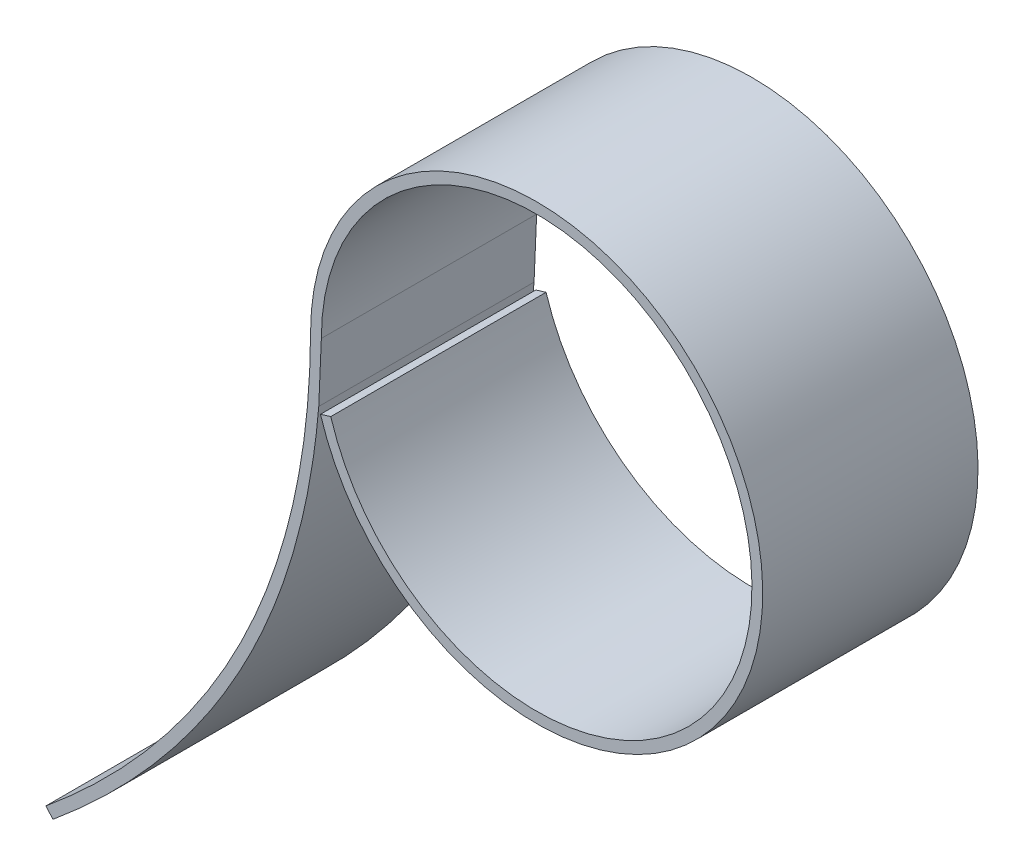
ISO-10303-21;
HEADER;
FILE_DESCRIPTION(('STEP AP214'),'2;1');
FILE_NAME('part.step','',(''),(''),'','','');
FILE_SCHEMA(('AUTOMOTIVE_DESIGN { 1 0 10303 214 1 1 1 1 }'));
ENDSEC;
DATA;
#1=APPLICATION_CONTEXT('core data for automotive mechanical design processes');
#2=APPLICATION_PROTOCOL_DEFINITION('international standard','automotive_design',2000,#1);
#3=PRODUCT_CONTEXT('',#1,'mechanical');
#4=PRODUCT('Part','Part','',(#3));
#5=PRODUCT_RELATED_PRODUCT_CATEGORY('part','',(#4));
#6=PRODUCT_DEFINITION_FORMATION('','',#4);
#7=PRODUCT_DEFINITION_CONTEXT('part definition',#1,'design');
#8=PRODUCT_DEFINITION('design','',#6,#7);
#9=PRODUCT_DEFINITION_SHAPE('','',#8);
#10=(LENGTH_UNIT() NAMED_UNIT(*) SI_UNIT(.MILLI.,.METRE.));
#11=(NAMED_UNIT(*) PLANE_ANGLE_UNIT() SI_UNIT($,.RADIAN.));
#12=(NAMED_UNIT(*) SI_UNIT($,.STERADIAN.) SOLID_ANGLE_UNIT());
#13=UNCERTAINTY_MEASURE_WITH_UNIT(LENGTH_MEASURE(1.E-05),#10,'distance_accuracy_value','');
#14=(GEOMETRIC_REPRESENTATION_CONTEXT(3) GLOBAL_UNCERTAINTY_ASSIGNED_CONTEXT((#13)) GLOBAL_UNIT_ASSIGNED_CONTEXT((#10,
#11,#12)) REPRESENTATION_CONTEXT('',''));
#15=CARTESIAN_POINT('',(0.,0.,0.));
#16=DIRECTION('',(0.,0.,1.));
#17=DIRECTION('',(1.,0.,0.));
#18=AXIS2_PLACEMENT_3D('',#15,#16,#17);
#19=CARTESIAN_POINT('',(-21.,0.,20.));
#20=CARTESIAN_POINT('',(-21.1540801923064,-30.1386727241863,20.));
#21=CARTESIAN_POINT('',(-45.5763785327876,-50.393394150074,20.));
#22=B_SPLINE_CURVE_WITH_KNOTS('',2,(#19,#20,#21),.UNSPECIFIED.,.F.,.F.,(3,3),(0.,1.),.UNSPECIFIED.);
#23=DIRECTION('',(0.,0.,-1.));
#24=VECTOR('',#23,1.);
#25=SURFACE_OF_LINEAR_EXTRUSION('',#22,#24);
#26=CARTESIAN_POINT('',(-21.,0.,0.));
#27=CARTESIAN_POINT('',(-21.1540801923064,-30.1386727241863,0.));
#28=CARTESIAN_POINT('',(-45.5763785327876,-50.393394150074,0.));
#29=B_SPLINE_CURVE_WITH_KNOTS('',2,(#26,#27,#28),.UNSPECIFIED.,.F.,.F.,(3,3),(0.,1.),.UNSPECIFIED.);
#30=CARTESIAN_POINT('',(-21.,0.,0.));
#31=VERTEX_POINT('',#30);
#32=CARTESIAN_POINT('',(-45.5763785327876,-50.393394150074,0.));
#33=VERTEX_POINT('',#32);
#34=EDGE_CURVE('E122',#31,#33,#29,.T.);
#35=ORIENTED_EDGE('',*,*,#34,.T.);
#36=DIRECTION('',(0.,0.,-1.));
#37=VECTOR('',#36,1.);
#38=CARTESIAN_POINT('',(-45.5763785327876,-50.393394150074,20.));
#39=LINE('',#38,#37);
#40=CARTESIAN_POINT('',(-45.5763785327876,-50.393394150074,20.));
#41=VERTEX_POINT('',#40);
#42=EDGE_CURVE('E11',#41,#33,#39,.T.);
#43=ORIENTED_EDGE('',*,*,#42,.F.);
#44=CARTESIAN_POINT('',(-21.,0.,20.));
#45=VERTEX_POINT('',#44);
#46=EDGE_CURVE('E144',#45,#41,#22,.T.);
#47=ORIENTED_EDGE('',*,*,#46,.F.);
#48=DIRECTION('',(0.,0.,-1.));
#49=VECTOR('',#48,1.);
#50=CARTESIAN_POINT('',(-21.,0.,20.));
#51=LINE('',#50,#49);
#52=EDGE_CURVE('E118',#45,#31,#51,.T.);
#53=ORIENTED_EDGE('',*,*,#52,.T.);
#54=EDGE_LOOP('',(#35,#43,#47,#53));
#55=FACE_BOUND('',#54,.T.);
#56=ADVANCED_FACE('F31',(#55),#25,.F.);
#57=CARTESIAN_POINT('',(-45.5763785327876,-50.393394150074,20.));
#58=DIRECTION('',(0.769725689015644,0.638374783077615,0.));
#59=DIRECTION('',(-0.638374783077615,0.769725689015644,0.));
#60=AXIS2_PLACEMENT_3D('',#57,#58,#59);
#61=PLANE('',#60);
#62=DIRECTION('',(0.638374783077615,-0.769725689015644,0.));
#63=VECTOR('',#62,1.);
#64=CARTESIAN_POINT('',(-45.5763785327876,-50.393394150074,0.));
#65=LINE('',#64,#63);
#66=CARTESIAN_POINT('',(-44.93800374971,-51.1631198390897,0.));
#67=VERTEX_POINT('',#66);
#68=EDGE_CURVE('E127',#33,#67,#65,.T.);
#69=ORIENTED_EDGE('',*,*,#68,.T.);
#70=DIRECTION('',(0.,0.,-1.));
#71=VECTOR('',#70,1.);
#72=CARTESIAN_POINT('',(-44.93800374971,-51.1631198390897,20.));
#73=LINE('',#72,#71);
#74=CARTESIAN_POINT('',(-44.93800374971,-51.1631198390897,20.));
#75=VERTEX_POINT('',#74);
#76=EDGE_CURVE('E40',#75,#67,#73,.T.);
#77=ORIENTED_EDGE('',*,*,#76,.F.);
#78=DIRECTION('',(0.638374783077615,-0.769725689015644,0.));
#79=VECTOR('',#78,1.);
#80=CARTESIAN_POINT('',(-45.5763785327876,-50.393394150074,20.));
#81=LINE('',#80,#79);
#82=EDGE_CURVE('E88',#41,#75,#81,.T.);
#83=ORIENTED_EDGE('',*,*,#82,.F.);
#84=ORIENTED_EDGE('',*,*,#42,.T.);
#85=EDGE_LOOP('',(#69,#77,#83,#84));
#86=FACE_BOUND('',#85,.T.);
#87=ADVANCED_FACE('F174',(#86),#61,.F.);
#88=CARTESIAN_POINT('',(-44.93800374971,-51.1631198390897,20.));
#89=CARTESIAN_POINT('',(-43.9205854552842,-50.3193163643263,20.));
#90=CARTESIAN_POINT('',(-41.9079099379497,-48.5710386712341,20.));
#91=CARTESIAN_POINT('',(-38.1781224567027,-45.0028858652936,20.));
#92=CARTESIAN_POINT('',(-33.9758748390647,-40.3293490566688,20.));
#93=CARTESIAN_POINT('',(-29.7024409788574,-34.4046519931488,20.));
#94=CARTESIAN_POINT('',(-26.1940047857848,-28.1587799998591,20.));
#95=CARTESIAN_POINT('',(-23.4559239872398,-21.5962643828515,20.));
#96=CARTESIAN_POINT('',(-21.489582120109,-14.723241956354,20.));
#97=CARTESIAN_POINT('',(-20.494404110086,-8.73425114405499,20.));
#98=CARTESIAN_POINT('',(-20.0837429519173,-3.80322063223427,20.));
#99=CARTESIAN_POINT('',(-20.0065972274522,-1.26571875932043,20.));
#100=CARTESIAN_POINT('',(-20.0001553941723,-0.00510673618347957,20.));
#101=B_SPLINE_CURVE_WITH_KNOTS('',3,(#88,#89,#90,#91,#92,#93,#94,#95,#96,#97,#98,#99,#100),
.UNSPECIFIED.,.F.,.F.,(4,1,1,1,1,1,1,1,1,1,4),(0.,0.0625,0.125,0.25,0.375,0.5,0.625,0.75,0.875,
0.9375,1.),.UNSPECIFIED.);
#102=DIRECTION('',(0.,0.,-1.));
#103=VECTOR('',#102,1.);
#104=SURFACE_OF_LINEAR_EXTRUSION('',#101,#103);
#105=CARTESIAN_POINT('',(-44.93800374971,-51.1631198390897,0.));
#106=CARTESIAN_POINT('',(-43.9205854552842,-50.3193163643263,0.));
#107=CARTESIAN_POINT('',(-41.9079099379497,-48.5710386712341,0.));
#108=CARTESIAN_POINT('',(-38.1781224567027,-45.0028858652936,0.));
#109=CARTESIAN_POINT('',(-33.9758748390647,-40.3293490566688,0.));
#110=CARTESIAN_POINT('',(-29.7024409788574,-34.4046519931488,0.));
#111=CARTESIAN_POINT('',(-26.1940047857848,-28.1587799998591,0.));
#112=CARTESIAN_POINT('',(-23.4559239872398,-21.5962643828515,0.));
#113=CARTESIAN_POINT('',(-21.489582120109,-14.723241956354,0.));
#114=CARTESIAN_POINT('',(-20.494404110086,-8.73425114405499,0.));
#115=CARTESIAN_POINT('',(-20.0837429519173,-3.80322063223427,0.));
#116=CARTESIAN_POINT('',(-20.0065972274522,-1.26571875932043,0.));
#117=CARTESIAN_POINT('',(-20.0001553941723,-0.00510673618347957,0.));
#118=B_SPLINE_CURVE_WITH_KNOTS('',3,(#105,#106,#107,#108,#109,#110,#111,#112,#113,#114,#115,
#116,#117),.UNSPECIFIED.,.F.,.F.,(4,1,1,1,1,1,1,1,1,1,4),(0.,0.0625,0.125,0.25,0.375,0.5,0.625,
0.75,0.875,0.9375,1.),.UNSPECIFIED.);
#119=CARTESIAN_POINT('',(-20.241234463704,-5.59396347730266,0.));
#120=VERTEX_POINT('',#119);
#121=EDGE_CURVE('E132',#67,#120,#118,.T.);
#122=ORIENTED_EDGE('',*,*,#121,.T.);
#123=DIRECTION('',(0.,0.,-1.));
#124=VECTOR('',#123,1.);
#125=CARTESIAN_POINT('',(-20.241234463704,-5.59396347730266,20.));
#126=LINE('',#125,#124);
#127=CARTESIAN_POINT('',(-20.241234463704,-5.59396347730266,20.));
#128=VERTEX_POINT('',#127);
#129=EDGE_CURVE('E148',#128,#120,#126,.T.);
#130=ORIENTED_EDGE('',*,*,#129,.F.);
#131=EDGE_CURVE('E156',#75,#128,#101,.T.);
#132=ORIENTED_EDGE('',*,*,#131,.F.);
#133=ORIENTED_EDGE('',*,*,#76,.T.);
#134=EDGE_LOOP('',(#122,#130,#132,#133));
#135=FACE_BOUND('',#134,.T.);
#136=ADVANCED_FACE('F154',(#135),#104,.F.);
#137=CARTESIAN_POINT('',(-20.241234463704,-5.59396347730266,20.));
#138=DIRECTION('',(-0.999071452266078,0.043084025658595,0.));
#139=DIRECTION('',(-0.043084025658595,-0.999071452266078,0.));
#140=AXIS2_PLACEMENT_3D('',#137,#138,#139);
#141=PLANE('',#140);
#142=DIRECTION('',(0.043084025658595,0.999071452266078,0.));
#143=VECTOR('',#142,1.);
#144=CARTESIAN_POINT('',(-20.241234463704,-5.59396347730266,0.));
#145=LINE('',#144,#143);
#146=CARTESIAN_POINT('',(-20.,0.,0.));
#147=VERTEX_POINT('',#146);
#148=EDGE_CURVE('E136',#120,#147,#145,.T.);
#149=ORIENTED_EDGE('',*,*,#148,.T.);
#150=DIRECTION('',(0.,0.,-1.));
#151=VECTOR('',#150,1.);
#152=CARTESIAN_POINT('',(-20.,0.,20.));
#153=LINE('',#152,#151);
#154=CARTESIAN_POINT('',(-20.,0.,20.));
#155=VERTEX_POINT('',#154);
#156=EDGE_CURVE('E113',#155,#147,#153,.T.);
#157=ORIENTED_EDGE('',*,*,#156,.F.);
#158=DIRECTION('',(0.043084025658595,0.999071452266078,0.));
#159=VECTOR('',#158,1.);
#160=CARTESIAN_POINT('',(-20.241234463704,-5.59396347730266,20.));
#161=LINE('',#160,#159);
#162=EDGE_CURVE('E104',#128,#155,#161,.T.);
#163=ORIENTED_EDGE('',*,*,#162,.F.);
#164=ORIENTED_EDGE('',*,*,#129,.T.);
#165=EDGE_LOOP('',(#149,#157,#163,#164));
#166=FACE_BOUND('',#165,.T.);
#167=ADVANCED_FACE('F162',(#166),#141,.F.);
#168=CARTESIAN_POINT('',(0.,0.,20.));
#169=DIRECTION('',(0.,0.,-1.));
#170=DIRECTION('',(-1.,0.,0.));
#171=AXIS2_PLACEMENT_3D('',#168,#169,#170);
#172=CYLINDRICAL_SURFACE('',#171,20.);
#173=CARTESIAN_POINT('',(0.,0.,0.));
#174=DIRECTION('',(0.,0.,-1.));
#175=DIRECTION('',(1.,0.,0.));
#176=AXIS2_PLACEMENT_3D('',#173,#174,#175);
#177=CIRCLE('',#176,20.);
#178=CARTESIAN_POINT('',(-19.1246635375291,-5.85211453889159,0.));
#179=VERTEX_POINT('',#178);
#180=EDGE_CURVE('E112',#147,#179,#177,.T.);
#181=ORIENTED_EDGE('',*,*,#180,.T.);
#182=DIRECTION('',(0.,0.,-1.));
#183=VECTOR('',#182,1.);
#184=CARTESIAN_POINT('',(-19.1246635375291,-5.85211453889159,20.));
#185=LINE('',#184,#183);
#186=CARTESIAN_POINT('',(-19.1246635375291,-5.85211453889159,20.));
#187=VERTEX_POINT('',#186);
#188=EDGE_CURVE('E109',#187,#179,#185,.T.);
#189=ORIENTED_EDGE('',*,*,#188,.F.);
#190=CARTESIAN_POINT('',(0.,0.,20.));
#191=DIRECTION('',(0.,0.,-1.));
#192=DIRECTION('',(1.,0.,0.));
#193=AXIS2_PLACEMENT_3D('',#190,#191,#192);
#194=CIRCLE('',#193,20.);
#195=EDGE_CURVE('E98',#155,#187,#194,.T.);
#196=ORIENTED_EDGE('',*,*,#195,.F.);
#197=ORIENTED_EDGE('',*,*,#156,.T.);
#198=EDGE_LOOP('',(#181,#189,#196,#197));
#199=FACE_BOUND('',#198,.T.);
#200=ADVANCED_FACE('F110',(#199),#172,.F.);
#201=CARTESIAN_POINT('',(-20.0808967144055,-6.14472026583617,20.));
#202=DIRECTION('',(0.292605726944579,-0.956233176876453,0.));
#203=DIRECTION('',(0.956233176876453,0.292605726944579,0.));
#204=AXIS2_PLACEMENT_3D('',#201,#202,#203);
#205=PLANE('',#204);
#206=DIRECTION('',(-0.956233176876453,-0.292605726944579,0.));
#207=VECTOR('',#206,1.);
#208=CARTESIAN_POINT('',(-20.0808967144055,-6.14472026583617,0.));
#209=LINE('',#208,#207);
#210=CARTESIAN_POINT('',(-20.0808967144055,-6.14472026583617,0.));
#211=VERTEX_POINT('',#210);
#212=EDGE_CURVE('E74',#179,#211,#209,.T.);
#213=ORIENTED_EDGE('',*,*,#212,.T.);
#214=DIRECTION('',(0.,0.,-1.));
#215=VECTOR('',#214,1.);
#216=CARTESIAN_POINT('',(-20.0808967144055,-6.14472026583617,20.));
#217=LINE('',#216,#215);
#218=CARTESIAN_POINT('',(-20.0808967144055,-6.14472026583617,20.));
#219=VERTEX_POINT('',#218);
#220=EDGE_CURVE('E114',#219,#211,#217,.T.);
#221=ORIENTED_EDGE('',*,*,#220,.F.);
#222=DIRECTION('',(-0.956233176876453,-0.292605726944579,0.));
#223=VECTOR('',#222,1.);
#224=CARTESIAN_POINT('',(-20.0808967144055,-6.14472026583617,20.));
#225=LINE('',#224,#223);
#226=EDGE_CURVE('E102',#187,#219,#225,.T.);
#227=ORIENTED_EDGE('',*,*,#226,.F.);
#228=ORIENTED_EDGE('',*,*,#188,.T.);
#229=EDGE_LOOP('',(#213,#221,#227,#228));
#230=FACE_BOUND('',#229,.T.);
#231=ADVANCED_FACE('F116',(#230),#205,.F.);
#232=CARTESIAN_POINT('',(0.,0.,20.));
#233=DIRECTION('',(0.,0.,-1.));
#234=DIRECTION('',(-1.,0.,0.));
#235=AXIS2_PLACEMENT_3D('',#232,#233,#234);
#236=CYLINDRICAL_SURFACE('',#235,21.);
#237=CARTESIAN_POINT('',(0.,0.,0.));
#238=DIRECTION('',(0.,0.,1.));
#239=DIRECTION('',(1.,0.,0.));
#240=AXIS2_PLACEMENT_3D('',#237,#238,#239);
#241=CIRCLE('',#240,21.);
#242=EDGE_CURVE('E80',#211,#31,#241,.T.);
#243=ORIENTED_EDGE('',*,*,#242,.T.);
#244=ORIENTED_EDGE('',*,*,#52,.F.);
#245=CARTESIAN_POINT('',(0.,0.,20.));
#246=DIRECTION('',(0.,0.,1.));
#247=DIRECTION('',(1.,0.,0.));
#248=AXIS2_PLACEMENT_3D('',#245,#246,#247);
#249=CIRCLE('',#248,21.);
#250=EDGE_CURVE('E48',#219,#45,#249,.T.);
#251=ORIENTED_EDGE('',*,*,#250,.F.);
#252=ORIENTED_EDGE('',*,*,#220,.T.);
#253=EDGE_LOOP('',(#243,#244,#251,#252));
#254=FACE_BOUND('',#253,.T.);
#255=ADVANCED_FACE('F183',(#254),#236,.T.);
#256=CARTESIAN_POINT('',(-27.2211347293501,-27.6676848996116,20.));
#257=DIRECTION('',(0.,0.,1.));
#258=DIRECTION('',(1.,0.,0.));
#259=AXIS2_PLACEMENT_3D('',#256,#257,#258);
#260=PLANE('',#259);
#261=ORIENTED_EDGE('',*,*,#46,.T.);
#262=ORIENTED_EDGE('',*,*,#82,.T.);
#263=ORIENTED_EDGE('',*,*,#131,.T.);
#264=ORIENTED_EDGE('',*,*,#162,.T.);
#265=ORIENTED_EDGE('',*,*,#195,.T.);
#266=ORIENTED_EDGE('',*,*,#226,.T.);
#267=ORIENTED_EDGE('',*,*,#250,.T.);
#268=EDGE_LOOP('',(#261,#262,#263,#264,#265,#266,#267));
#269=FACE_BOUND('',#268,.T.);
#270=ADVANCED_FACE('F100',(#269),#260,.T.);
#271=CARTESIAN_POINT('',(-27.2211347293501,-27.6676848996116,0.));
#272=DIRECTION('',(0.,0.,1.));
#273=DIRECTION('',(1.,0.,0.));
#274=AXIS2_PLACEMENT_3D('',#271,#272,#273);
#275=PLANE('',#274);
#276=ORIENTED_EDGE('',*,*,#34,.F.);
#277=ORIENTED_EDGE('',*,*,#242,.F.);
#278=ORIENTED_EDGE('',*,*,#212,.F.);
#279=ORIENTED_EDGE('',*,*,#180,.F.);
#280=ORIENTED_EDGE('',*,*,#148,.F.);
#281=ORIENTED_EDGE('',*,*,#121,.F.);
#282=ORIENTED_EDGE('',*,*,#68,.F.);
#283=EDGE_LOOP('',(#276,#277,#278,#279,#280,#281,#282));
#284=FACE_BOUND('',#283,.T.);
#285=ADVANCED_FACE('F160',(#284),#275,.F.);
#286=CLOSED_SHELL('',(#56,#87,#136,#167,#200,#231,#255,#270,#285));
#287=MANIFOLD_SOLID_BREP('B2',#286);
#288=ADVANCED_BREP_SHAPE_REPRESENTATION('',(#18,#287),#14);
#289=SHAPE_DEFINITION_REPRESENTATION(#9,#288);
ENDSEC;
END-ISO-10303-21;
